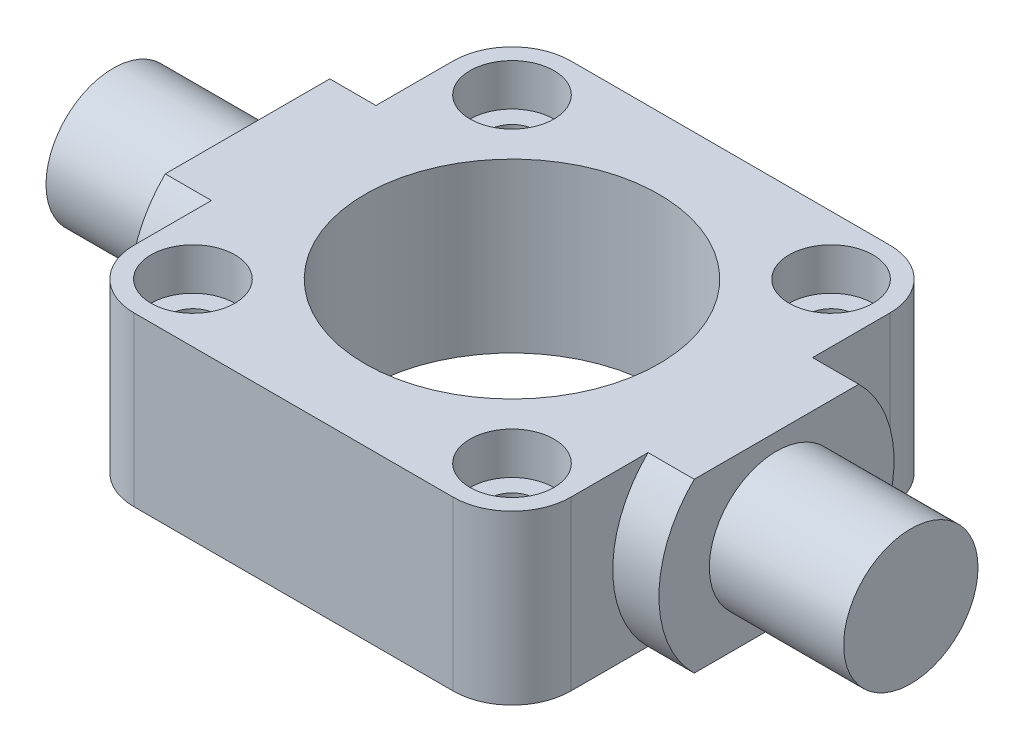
ISO-10303-21;
HEADER;
FILE_DESCRIPTION(('STEP AP214'),'2;1');
FILE_NAME('part.step','',(''),(''),'','','');
FILE_SCHEMA(('AUTOMOTIVE_DESIGN { 1 0 10303 214 1 1 1 1 }'));
ENDSEC;
DATA;
#1=APPLICATION_CONTEXT('core data for automotive mechanical design processes');
#2=APPLICATION_PROTOCOL_DEFINITION('international standard','automotive_design',2000,#1);
#3=PRODUCT_CONTEXT('',#1,'mechanical');
#4=PRODUCT('Part','Part','',(#3));
#5=PRODUCT_RELATED_PRODUCT_CATEGORY('part','',(#4));
#6=PRODUCT_DEFINITION_FORMATION('','',#4);
#7=PRODUCT_DEFINITION_CONTEXT('part definition',#1,'design');
#8=PRODUCT_DEFINITION('design','',#6,#7);
#9=PRODUCT_DEFINITION_SHAPE('','',#8);
#10=(LENGTH_UNIT() NAMED_UNIT(*) SI_UNIT(.MILLI.,.METRE.));
#11=(NAMED_UNIT(*) PLANE_ANGLE_UNIT() SI_UNIT($,.RADIAN.));
#12=(NAMED_UNIT(*) SI_UNIT($,.STERADIAN.) SOLID_ANGLE_UNIT());
#13=UNCERTAINTY_MEASURE_WITH_UNIT(LENGTH_MEASURE(1.E-05),#10,'distance_accuracy_value','');
#14=(GEOMETRIC_REPRESENTATION_CONTEXT(3) GLOBAL_UNCERTAINTY_ASSIGNED_CONTEXT((#13)) GLOBAL_UNIT_ASSIGNED_CONTEXT((#10,
#11,#12)) REPRESENTATION_CONTEXT('',''));
#15=CARTESIAN_POINT('',(0.,0.,0.));
#16=DIRECTION('',(0.,0.,1.));
#17=DIRECTION('',(1.,0.,0.));
#18=AXIS2_PLACEMENT_3D('',#15,#16,#17);
#19=CARTESIAN_POINT('',(-19.,20.0000000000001,19.));
#20=DIRECTION('',(0.,1.,0.));
#21=DIRECTION('',(0.,0.,1.));
#22=AXIS2_PLACEMENT_3D('',#19,#20,#21);
#23=PLANE('',#22);
#24=CARTESIAN_POINT('',(-19.0000000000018,20.0000000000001,-19.));
#25=DIRECTION('',(0.,1.,0.));
#26=DIRECTION('',(0.,0.,1.));
#27=AXIS2_PLACEMENT_3D('',#24,#25,#26);
#28=CIRCLE('',#27,5.);
#29=CARTESIAN_POINT('',(-19.0000000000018,20.0000000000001,-14.));
#30=VERTEX_POINT('',#29);
#31=EDGE_CURVE('E419',#30,#30,#28,.T.);
#32=ORIENTED_EDGE('',*,*,#31,.F.);
#33=EDGE_LOOP('',(#32));
#34=FACE_BOUND('',#33,.T.);
#35=CARTESIAN_POINT('',(18.9999999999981,20.0000000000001,-19.));
#36=DIRECTION('',(0.,1.,0.));
#37=DIRECTION('',(0.,0.,1.));
#38=AXIS2_PLACEMENT_3D('',#35,#36,#37);
#39=CIRCLE('',#38,5.);
#40=CARTESIAN_POINT('',(18.9999999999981,20.0000000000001,-14.));
#41=VERTEX_POINT('',#40);
#42=EDGE_CURVE('E327',#41,#41,#39,.T.);
#43=ORIENTED_EDGE('',*,*,#42,.F.);
#44=EDGE_LOOP('',(#43));
#45=FACE_BOUND('',#44,.T.);
#46=CARTESIAN_POINT('',(19.,20.0000000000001,19.));
#47=DIRECTION('',(0.,1.,0.));
#48=DIRECTION('',(0.,0.,1.));
#49=AXIS2_PLACEMENT_3D('',#46,#47,#48);
#50=CIRCLE('',#49,5.);
#51=CARTESIAN_POINT('',(19.,20.0000000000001,24.));
#52=VERTEX_POINT('',#51);
#53=EDGE_CURVE('E340',#52,#52,#50,.T.);
#54=ORIENTED_EDGE('',*,*,#53,.F.);
#55=EDGE_LOOP('',(#54));
#56=FACE_BOUND('',#55,.T.);
#57=CARTESIAN_POINT('',(-19.,20.0000000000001,19.));
#58=DIRECTION('',(0.,1.,0.));
#59=DIRECTION('',(0.,0.,1.));
#60=AXIS2_PLACEMENT_3D('',#57,#58,#59);
#61=CIRCLE('',#60,5.);
#62=CARTESIAN_POINT('',(-19.,20.0000000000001,24.));
#63=VERTEX_POINT('',#62);
#64=EDGE_CURVE('E356',#63,#63,#61,.T.);
#65=ORIENTED_EDGE('',*,*,#64,.F.);
#66=EDGE_LOOP('',(#65));
#67=FACE_BOUND('',#66,.T.);
#68=CARTESIAN_POINT('',(0.,20.0000000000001,0.));
#69=DIRECTION('',(0.,1.,0.));
#70=DIRECTION('',(0.,0.,1.));
#71=AXIS2_PLACEMENT_3D('',#68,#69,#70);
#72=CIRCLE('',#71,17.5);
#73=CARTESIAN_POINT('',(0.,20.0000000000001,17.5));
#74=VERTEX_POINT('',#73);
#75=EDGE_CURVE('E202',#74,#74,#72,.T.);
#76=ORIENTED_EDGE('',*,*,#75,.F.);
#77=EDGE_LOOP('',(#76));
#78=FACE_BOUND('',#77,.T.);
#79=DIRECTION('',(-1.,0.,0.));
#80=VECTOR('',#79,1.);
#81=CARTESIAN_POINT('',(47.5,20.,9.79795897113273));
#82=LINE('',#81,#80);
#83=CARTESIAN_POINT('',(31.5,20.,9.79795897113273));
#84=VERTEX_POINT('',#83);
#85=CARTESIAN_POINT('',(25.9999999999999,20.,9.79795897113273));
#86=VERTEX_POINT('',#85);
#87=EDGE_CURVE('E195',#84,#86,#82,.T.);
#88=ORIENTED_EDGE('',*,*,#87,.F.);
#89=DIRECTION('',(0.,0.,-1.));
#90=VECTOR('',#89,1.);
#91=CARTESIAN_POINT('',(31.5,20.,19.));
#92=LINE('',#91,#90);
#93=CARTESIAN_POINT('',(31.5,20.,-9.79795897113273));
#94=VERTEX_POINT('',#93);
#95=EDGE_CURVE('E55',#84,#94,#92,.T.);
#96=ORIENTED_EDGE('',*,*,#95,.T.);
#97=DIRECTION('',(-1.,0.,0.));
#98=VECTOR('',#97,1.);
#99=CARTESIAN_POINT('',(47.5,20.,-9.79795897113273));
#100=LINE('',#99,#98);
#101=CARTESIAN_POINT('',(25.9999999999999,20.,-9.79795897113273));
#102=VERTEX_POINT('',#101);
#103=EDGE_CURVE('E191',#102,#94,#100,.F.);
#104=ORIENTED_EDGE('',*,*,#103,.F.);
#105=DIRECTION('',(0.,0.,-1.));
#106=VECTOR('',#105,1.);
#107=CARTESIAN_POINT('',(25.9999999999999,20.,19.));
#108=LINE('',#107,#106);
#109=CARTESIAN_POINT('',(25.9999999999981,20.,-19.));
#110=VERTEX_POINT('',#109);
#111=EDGE_CURVE('E243',#102,#110,#108,.T.);
#112=ORIENTED_EDGE('',*,*,#111,.T.);
#113=CARTESIAN_POINT('',(18.9999999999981,20.0000000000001,-19.));
#114=DIRECTION('',(0.,1.,0.));
#115=DIRECTION('',(0.,0.,1.));
#116=AXIS2_PLACEMENT_3D('',#113,#114,#115);
#117=CIRCLE('',#116,7.);
#118=CARTESIAN_POINT('',(18.9999999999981,20.0000000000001,-26.));
#119=VERTEX_POINT('',#118);
#120=EDGE_CURVE('E248',#110,#119,#117,.T.);
#121=ORIENTED_EDGE('',*,*,#120,.T.);
#122=DIRECTION('',(-1.,0.,0.));
#123=VECTOR('',#122,1.);
#124=CARTESIAN_POINT('',(-19.0000000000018,20.0000000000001,-26.));
#125=LINE('',#124,#123);
#126=CARTESIAN_POINT('',(-19.0000000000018,20.0000000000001,-26.));
#127=VERTEX_POINT('',#126);
#128=EDGE_CURVE('E251',#119,#127,#125,.T.);
#129=ORIENTED_EDGE('',*,*,#128,.T.);
#130=CARTESIAN_POINT('',(-19.0000000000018,20.0000000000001,-19.));
#131=DIRECTION('',(0.,1.,0.));
#132=DIRECTION('',(0.,0.,-1.));
#133=AXIS2_PLACEMENT_3D('',#130,#131,#132);
#134=CIRCLE('',#133,7.);
#135=CARTESIAN_POINT('',(-26.0000000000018,20.0000000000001,-19.));
#136=VERTEX_POINT('',#135);
#137=EDGE_CURVE('E254',#127,#136,#134,.T.);
#138=ORIENTED_EDGE('',*,*,#137,.T.);
#139=DIRECTION('',(0.,0.,1.));
#140=VECTOR('',#139,1.);
#141=CARTESIAN_POINT('',(-26.,20.0000000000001,19.));
#142=LINE('',#141,#140);
#143=CARTESIAN_POINT('',(-26.0000000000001,20.0000000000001,-9.79795897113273));
#144=VERTEX_POINT('',#143);
#145=EDGE_CURVE('E258',#136,#144,#142,.T.);
#146=ORIENTED_EDGE('',*,*,#145,.T.);
#147=DIRECTION('',(1.,0.,0.));
#148=VECTOR('',#147,1.);
#149=CARTESIAN_POINT('',(-47.5000000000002,20.0000000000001,-9.79795897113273));
#150=LINE('',#149,#148);
#151=CARTESIAN_POINT('',(-31.5000000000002,20.0000000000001,-9.79795897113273));
#152=VERTEX_POINT('',#151);
#153=EDGE_CURVE('E188',#152,#144,#150,.T.);
#154=ORIENTED_EDGE('',*,*,#153,.F.);
#155=DIRECTION('',(0.,0.,1.));
#156=VECTOR('',#155,1.);
#157=CARTESIAN_POINT('',(-31.5000000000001,20.0000000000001,19.));
#158=LINE('',#157,#156);
#159=CARTESIAN_POINT('',(-31.5000000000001,20.0000000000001,9.79795897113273));
#160=VERTEX_POINT('',#159);
#161=EDGE_CURVE('E63',#152,#160,#158,.T.);
#162=ORIENTED_EDGE('',*,*,#161,.T.);
#163=DIRECTION('',(1.,0.,0.));
#164=VECTOR('',#163,1.);
#165=CARTESIAN_POINT('',(-47.5000000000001,20.0000000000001,9.79795897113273));
#166=LINE('',#165,#164);
#167=CARTESIAN_POINT('',(-26.,20.0000000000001,9.79795897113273));
#168=VERTEX_POINT('',#167);
#169=EDGE_CURVE('E178',#168,#160,#166,.F.);
#170=ORIENTED_EDGE('',*,*,#169,.F.);
#171=CARTESIAN_POINT('',(-26.,20.0000000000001,19.));
#172=VERTEX_POINT('',#171);
#173=EDGE_CURVE('E257',#168,#172,#142,.T.);
#174=ORIENTED_EDGE('',*,*,#173,.T.);
#175=CARTESIAN_POINT('',(-19.,20.0000000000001,19.));
#176=DIRECTION('',(0.,1.,0.));
#177=DIRECTION('',(0.,0.,1.));
#178=AXIS2_PLACEMENT_3D('',#175,#176,#177);
#179=CIRCLE('',#178,7.);
#180=CARTESIAN_POINT('',(-19.0000000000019,20.0000000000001,26.));
#181=VERTEX_POINT('',#180);
#182=EDGE_CURVE('E234',#172,#181,#179,.T.);
#183=ORIENTED_EDGE('',*,*,#182,.T.);
#184=DIRECTION('',(1.,0.,0.));
#185=VECTOR('',#184,1.);
#186=CARTESIAN_POINT('',(-19.0000000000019,20.0000000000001,26.));
#187=LINE('',#186,#185);
#188=CARTESIAN_POINT('',(18.9999999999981,20.0000000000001,26.));
#189=VERTEX_POINT('',#188);
#190=EDGE_CURVE('E238',#181,#189,#187,.T.);
#191=ORIENTED_EDGE('',*,*,#190,.T.);
#192=CARTESIAN_POINT('',(19.,20.0000000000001,19.));
#193=DIRECTION('',(0.,1.,0.));
#194=DIRECTION('',(0.,0.,-1.));
#195=AXIS2_PLACEMENT_3D('',#192,#193,#194);
#196=CIRCLE('',#195,7.);
#197=CARTESIAN_POINT('',(25.9999999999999,20.,19.));
#198=VERTEX_POINT('',#197);
#199=EDGE_CURVE('E240',#189,#198,#196,.T.);
#200=ORIENTED_EDGE('',*,*,#199,.T.);
#201=EDGE_CURVE('E244',#198,#86,#108,.T.);
#202=ORIENTED_EDGE('',*,*,#201,.T.);
#203=EDGE_LOOP('',(#88,#96,#104,#112,#121,#129,#138,#146,#154,#162,#170,#174,#183,#191,#200,#202));
#204=FACE_BOUND('',#203,.T.);
#205=ADVANCED_FACE('F40',(#34,#45,#56,#67,#78,#204),#23,.T.);
#206=CARTESIAN_POINT('',(-19.,0.,19.));
#207=DIRECTION('',(0.,1.,0.));
#208=DIRECTION('',(0.,0.,1.));
#209=AXIS2_PLACEMENT_3D('',#206,#207,#208);
#210=PLANE('',#209);
#211=CARTESIAN_POINT('',(-19.,0.,-19.));
#212=DIRECTION('',(0.,1.,0.));
#213=DIRECTION('',(0.,0.,1.));
#214=AXIS2_PLACEMENT_3D('',#211,#212,#213);
#215=CIRCLE('',#214,2.75);
#216=CARTESIAN_POINT('',(-19.,0.,-16.25));
#217=VERTEX_POINT('',#216);
#218=EDGE_CURVE('E446',#217,#217,#215,.T.);
#219=ORIENTED_EDGE('',*,*,#218,.T.);
#220=EDGE_LOOP('',(#219));
#221=FACE_BOUND('',#220,.T.);
#222=CARTESIAN_POINT('',(19.,0.,-19.));
#223=DIRECTION('',(0.,1.,0.));
#224=DIRECTION('',(0.,0.,1.));
#225=AXIS2_PLACEMENT_3D('',#222,#223,#224);
#226=CIRCLE('',#225,2.75);
#227=CARTESIAN_POINT('',(19.,0.,-16.25));
#228=VERTEX_POINT('',#227);
#229=EDGE_CURVE('E421',#228,#228,#226,.T.);
#230=ORIENTED_EDGE('',*,*,#229,.T.);
#231=EDGE_LOOP('',(#230));
#232=FACE_BOUND('',#231,.T.);
#233=CARTESIAN_POINT('',(19.,0.,19.));
#234=DIRECTION('',(0.,1.,0.));
#235=DIRECTION('',(0.,0.,1.));
#236=AXIS2_PLACEMENT_3D('',#233,#234,#235);
#237=CIRCLE('',#236,2.75);
#238=CARTESIAN_POINT('',(19.,0.,21.75));
#239=VERTEX_POINT('',#238);
#240=EDGE_CURVE('E323',#239,#239,#237,.T.);
#241=ORIENTED_EDGE('',*,*,#240,.T.);
#242=EDGE_LOOP('',(#241));
#243=FACE_BOUND('',#242,.T.);
#244=CARTESIAN_POINT('',(-19.,0.,19.));
#245=DIRECTION('',(0.,1.,0.));
#246=DIRECTION('',(0.,0.,1.));
#247=AXIS2_PLACEMENT_3D('',#244,#245,#246);
#248=CIRCLE('',#247,2.75);
#249=CARTESIAN_POINT('',(-19.,0.,21.75));
#250=VERTEX_POINT('',#249);
#251=EDGE_CURVE('E344',#250,#250,#248,.T.);
#252=ORIENTED_EDGE('',*,*,#251,.T.);
#253=EDGE_LOOP('',(#252));
#254=FACE_BOUND('',#253,.T.);
#255=CARTESIAN_POINT('',(0.,0.,0.));
#256=DIRECTION('',(0.,1.,0.));
#257=DIRECTION('',(0.,0.,1.));
#258=AXIS2_PLACEMENT_3D('',#255,#256,#257);
#259=CIRCLE('',#258,17.5);
#260=CARTESIAN_POINT('',(0.,0.,17.5));
#261=VERTEX_POINT('',#260);
#262=EDGE_CURVE('E198',#261,#261,#259,.T.);
#263=ORIENTED_EDGE('',*,*,#262,.T.);
#264=EDGE_LOOP('',(#263));
#265=FACE_BOUND('',#264,.T.);
#266=DIRECTION('',(0.,0.,-1.));
#267=VECTOR('',#266,1.);
#268=CARTESIAN_POINT('',(31.5,1.17961196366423E-13,19.));
#269=LINE('',#268,#267);
#270=CARTESIAN_POINT('',(31.5,1.17961196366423E-13,9.79795897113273));
#271=VERTEX_POINT('',#270);
#272=CARTESIAN_POINT('',(31.5,0.,-9.79795897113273));
#273=VERTEX_POINT('',#272);
#274=EDGE_CURVE('E152',#271,#273,#269,.T.);
#275=ORIENTED_EDGE('',*,*,#274,.F.);
#276=DIRECTION('',(-1.,0.,0.));
#277=VECTOR('',#276,1.);
#278=CARTESIAN_POINT('',(47.5,1.17961196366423E-13,9.79795897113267));
#279=LINE('',#278,#277);
#280=CARTESIAN_POINT('',(26.,1.17961196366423E-13,9.79795897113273));
#281=VERTEX_POINT('',#280);
#282=EDGE_CURVE('E161',#281,#271,#279,.F.);
#283=ORIENTED_EDGE('',*,*,#282,.F.);
#284=DIRECTION('',(0.,0.,-1.));
#285=VECTOR('',#284,1.);
#286=CARTESIAN_POINT('',(26.,1.17961196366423E-13,19.));
#287=LINE('',#286,#285);
#288=CARTESIAN_POINT('',(26.,1.17961196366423E-13,19.));
#289=VERTEX_POINT('',#288);
#290=EDGE_CURVE('E217',#289,#281,#287,.T.);
#291=ORIENTED_EDGE('',*,*,#290,.F.);
#292=CARTESIAN_POINT('',(19.,0.,19.));
#293=DIRECTION('',(0.,1.,0.));
#294=DIRECTION('',(0.,0.,-1.));
#295=AXIS2_PLACEMENT_3D('',#292,#293,#294);
#296=CIRCLE('',#295,7.);
#297=CARTESIAN_POINT('',(18.9999999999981,0.,26.));
#298=VERTEX_POINT('',#297);
#299=EDGE_CURVE('E213',#298,#289,#296,.T.);
#300=ORIENTED_EDGE('',*,*,#299,.F.);
#301=DIRECTION('',(1.,0.,0.));
#302=VECTOR('',#301,1.);
#303=CARTESIAN_POINT('',(-19.0000000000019,0.,26.));
#304=LINE('',#303,#302);
#305=CARTESIAN_POINT('',(-19.0000000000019,0.,26.));
#306=VERTEX_POINT('',#305);
#307=EDGE_CURVE('E210',#306,#298,#304,.T.);
#308=ORIENTED_EDGE('',*,*,#307,.F.);
#309=CARTESIAN_POINT('',(-19.,0.,19.));
#310=DIRECTION('',(0.,1.,0.));
#311=DIRECTION('',(0.,0.,1.));
#312=AXIS2_PLACEMENT_3D('',#309,#310,#311);
#313=CIRCLE('',#312,7.);
#314=CARTESIAN_POINT('',(-26.,0.,19.));
#315=VERTEX_POINT('',#314);
#316=EDGE_CURVE('E206',#315,#306,#313,.T.);
#317=ORIENTED_EDGE('',*,*,#316,.F.);
#318=DIRECTION('',(0.,0.,1.));
#319=VECTOR('',#318,1.);
#320=CARTESIAN_POINT('',(-26.,0.,19.));
#321=LINE('',#320,#319);
#322=CARTESIAN_POINT('',(-26.,1.17961196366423E-13,9.79795897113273));
#323=VERTEX_POINT('',#322);
#324=EDGE_CURVE('E229',#323,#315,#321,.T.);
#325=ORIENTED_EDGE('',*,*,#324,.F.);
#326=DIRECTION('',(1.,0.,0.));
#327=VECTOR('',#326,1.);
#328=CARTESIAN_POINT('',(-47.5,1.17961196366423E-13,9.79795897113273));
#329=LINE('',#328,#327);
#330=CARTESIAN_POINT('',(-31.5,1.17961196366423E-13,9.79795897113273));
#331=VERTEX_POINT('',#330);
#332=EDGE_CURVE('E173',#331,#323,#329,.T.);
#333=ORIENTED_EDGE('',*,*,#332,.F.);
#334=DIRECTION('',(0.,0.,1.));
#335=VECTOR('',#334,1.);
#336=CARTESIAN_POINT('',(-31.5,0.,19.));
#337=LINE('',#336,#335);
#338=CARTESIAN_POINT('',(-31.5,0.,-9.79795897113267));
#339=VERTEX_POINT('',#338);
#340=EDGE_CURVE('E379',#339,#331,#337,.T.);
#341=ORIENTED_EDGE('',*,*,#340,.F.);
#342=DIRECTION('',(1.,0.,0.));
#343=VECTOR('',#342,1.);
#344=CARTESIAN_POINT('',(-47.5,0.,-9.79795897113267));
#345=LINE('',#344,#343);
#346=CARTESIAN_POINT('',(-26.,0.,-9.79795897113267));
#347=VERTEX_POINT('',#346);
#348=EDGE_CURVE('E181',#347,#339,#345,.F.);
#349=ORIENTED_EDGE('',*,*,#348,.F.);
#350=CARTESIAN_POINT('',(-26.,0.,-19.));
#351=VERTEX_POINT('',#350);
#352=EDGE_CURVE('E230',#351,#347,#321,.T.);
#353=ORIENTED_EDGE('',*,*,#352,.F.);
#354=CARTESIAN_POINT('',(-19.,0.,-19.));
#355=DIRECTION('',(0.,1.,0.));
#356=DIRECTION('',(0.,0.,-1.));
#357=AXIS2_PLACEMENT_3D('',#354,#355,#356);
#358=CIRCLE('',#357,7.);
#359=CARTESIAN_POINT('',(-19.,0.,-26.));
#360=VERTEX_POINT('',#359);
#361=EDGE_CURVE('E226',#360,#351,#358,.T.);
#362=ORIENTED_EDGE('',*,*,#361,.F.);
#363=DIRECTION('',(-1.,0.,0.));
#364=VECTOR('',#363,1.);
#365=CARTESIAN_POINT('',(-19.,0.,-26.));
#366=LINE('',#365,#364);
#367=CARTESIAN_POINT('',(19.,0.,-26.));
#368=VERTEX_POINT('',#367);
#369=EDGE_CURVE('E223',#368,#360,#366,.T.);
#370=ORIENTED_EDGE('',*,*,#369,.F.);
#371=CARTESIAN_POINT('',(19.,0.,-19.));
#372=DIRECTION('',(0.,1.,0.));
#373=DIRECTION('',(0.,0.,1.));
#374=AXIS2_PLACEMENT_3D('',#371,#372,#373);
#375=CIRCLE('',#374,7.);
#376=CARTESIAN_POINT('',(26.,1.17961196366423E-13,-19.));
#377=VERTEX_POINT('',#376);
#378=EDGE_CURVE('E220',#377,#368,#375,.T.);
#379=ORIENTED_EDGE('',*,*,#378,.F.);
#380=CARTESIAN_POINT('',(26.,0.,-9.79795897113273));
#381=VERTEX_POINT('',#380);
#382=EDGE_CURVE('E216',#381,#377,#287,.T.);
#383=ORIENTED_EDGE('',*,*,#382,.F.);
#384=DIRECTION('',(-1.,0.,0.));
#385=VECTOR('',#384,1.);
#386=CARTESIAN_POINT('',(47.5,0.,-9.79795897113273));
#387=LINE('',#386,#385);
#388=EDGE_CURVE('E164',#273,#381,#387,.T.);
#389=ORIENTED_EDGE('',*,*,#388,.F.);
#390=EDGE_LOOP('',(#275,#283,#291,#300,#308,#317,#325,#333,#341,#349,#353,#362,#370,#379,#383,#389));
#391=FACE_BOUND('',#390,.T.);
#392=ADVANCED_FACE('F159',(#221,#232,#243,#254,#265,#391),#210,.F.);
#393=CARTESIAN_POINT('',(47.5,10.0000000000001,0.));
#394=DIRECTION('',(-1.,0.,0.));
#395=DIRECTION('',(0.,0.,1.));
#396=AXIS2_PLACEMENT_3D('',#393,#394,#395);
#397=CYLINDRICAL_SURFACE('',#396,14.);
#398=CARTESIAN_POINT('',(31.5,10.0000000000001,0.));
#399=DIRECTION('',(1.,0.,0.));
#400=DIRECTION('',(0.,0.,-1.));
#401=AXIS2_PLACEMENT_3D('',#398,#399,#400);
#402=CIRCLE('',#401,14.);
#403=EDGE_CURVE('E368',#273,#94,#402,.T.);
#404=ORIENTED_EDGE('',*,*,#403,.F.);
#405=ORIENTED_EDGE('',*,*,#388,.T.);
#406=CARTESIAN_POINT('',(26.,10.0000000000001,9.43689570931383E-13));
#407=DIRECTION('',(-1.,0.,0.));
#408=DIRECTION('',(0.,0.,1.));
#409=AXIS2_PLACEMENT_3D('',#406,#407,#408);
#410=CIRCLE('',#409,14.);
#411=EDGE_CURVE('E295',#381,#102,#410,.F.);
#412=ORIENTED_EDGE('',*,*,#411,.T.);
#413=ORIENTED_EDGE('',*,*,#103,.T.);
#414=EDGE_LOOP('',(#404,#405,#412,#413));
#415=FACE_BOUND('',#414,.T.);
#416=ADVANCED_FACE('F426',(#415),#397,.T.);
#417=CARTESIAN_POINT('',(31.5,10.0000000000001,0.));
#418=DIRECTION('',(1.,0.,0.));
#419=DIRECTION('',(0.,0.,-1.));
#420=AXIS2_PLACEMENT_3D('',#417,#418,#419);
#421=CIRCLE('',#420,14.);
#422=EDGE_CURVE('E12',#84,#271,#421,.T.);
#423=ORIENTED_EDGE('',*,*,#422,.F.);
#424=ORIENTED_EDGE('',*,*,#87,.T.);
#425=EDGE_CURVE('E171',#86,#281,#410,.F.);
#426=ORIENTED_EDGE('',*,*,#425,.T.);
#427=ORIENTED_EDGE('',*,*,#282,.T.);
#428=EDGE_LOOP('',(#423,#424,#426,#427));
#429=FACE_BOUND('',#428,.T.);
#430=ADVANCED_FACE('F169',(#429),#397,.T.);
#431=CARTESIAN_POINT('',(-47.5,10.,0.));
#432=DIRECTION('',(1.,0.,0.));
#433=DIRECTION('',(0.,0.,-1.));
#434=AXIS2_PLACEMENT_3D('',#431,#432,#433);
#435=CYLINDRICAL_SURFACE('',#434,14.);
#436=CARTESIAN_POINT('',(-31.5,10.,0.));
#437=DIRECTION('',(-1.,0.,0.));
#438=DIRECTION('',(0.,0.,1.));
#439=AXIS2_PLACEMENT_3D('',#436,#437,#438);
#440=CIRCLE('',#439,14.);
#441=EDGE_CURVE('E383',#331,#160,#440,.T.);
#442=ORIENTED_EDGE('',*,*,#441,.F.);
#443=ORIENTED_EDGE('',*,*,#332,.T.);
#444=CARTESIAN_POINT('',(-26.,10.,0.));
#445=DIRECTION('',(1.,0.,0.));
#446=DIRECTION('',(0.,0.,-1.));
#447=AXIS2_PLACEMENT_3D('',#444,#445,#446);
#448=CIRCLE('',#447,14.);
#449=EDGE_CURVE('E299',#323,#168,#448,.F.);
#450=ORIENTED_EDGE('',*,*,#449,.T.);
#451=ORIENTED_EDGE('',*,*,#169,.T.);
#452=EDGE_LOOP('',(#442,#443,#450,#451));
#453=FACE_BOUND('',#452,.T.);
#454=ADVANCED_FACE('F310',(#453),#435,.T.);
#455=CARTESIAN_POINT('',(-31.5,10.,0.));
#456=DIRECTION('',(-1.,0.,0.));
#457=DIRECTION('',(0.,0.,1.));
#458=AXIS2_PLACEMENT_3D('',#455,#456,#457);
#459=CIRCLE('',#458,14.);
#460=EDGE_CURVE('E49',#152,#339,#459,.T.);
#461=ORIENTED_EDGE('',*,*,#460,.F.);
#462=ORIENTED_EDGE('',*,*,#153,.T.);
#463=EDGE_CURVE('E296',#144,#347,#448,.F.);
#464=ORIENTED_EDGE('',*,*,#463,.T.);
#465=ORIENTED_EDGE('',*,*,#348,.T.);
#466=EDGE_LOOP('',(#461,#462,#464,#465));
#467=FACE_BOUND('',#466,.T.);
#468=ADVANCED_FACE('F388',(#467),#435,.T.);
#469=CARTESIAN_POINT('',(-26.,20.0000000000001,19.));
#470=DIRECTION('',(1.,0.,0.));
#471=DIRECTION('',(0.,0.,-1.));
#472=AXIS2_PLACEMENT_3D('',#469,#470,#471);
#473=PLANE('',#472);
#474=ORIENTED_EDGE('',*,*,#449,.F.);
#475=ORIENTED_EDGE('',*,*,#324,.T.);
#476=DIRECTION('',(0.,-1.,0.));
#477=VECTOR('',#476,1.);
#478=CARTESIAN_POINT('',(-26.,20.0000000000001,19.));
#479=LINE('',#478,#477);
#480=EDGE_CURVE('E262',#172,#315,#479,.T.);
#481=ORIENTED_EDGE('',*,*,#480,.F.);
#482=ORIENTED_EDGE('',*,*,#173,.F.);
#483=EDGE_LOOP('',(#474,#475,#481,#482));
#484=FACE_BOUND('',#483,.T.);
#485=ADVANCED_FACE('F315',(#484),#473,.F.);
#486=ORIENTED_EDGE('',*,*,#463,.F.);
#487=ORIENTED_EDGE('',*,*,#145,.F.);
#488=DIRECTION('',(0.,-1.,0.));
#489=VECTOR('',#488,1.);
#490=CARTESIAN_POINT('',(-26.0000000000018,20.0000000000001,-19.));
#491=LINE('',#490,#489);
#492=EDGE_CURVE('E266',#136,#351,#491,.T.);
#493=ORIENTED_EDGE('',*,*,#492,.T.);
#494=ORIENTED_EDGE('',*,*,#352,.T.);
#495=EDGE_LOOP('',(#486,#487,#493,#494));
#496=FACE_BOUND('',#495,.T.);
#497=ADVANCED_FACE('F394',(#496),#473,.F.);
#498=CARTESIAN_POINT('',(25.9999999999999,20.,19.));
#499=DIRECTION('',(-1.,0.,0.));
#500=DIRECTION('',(0.,0.,1.));
#501=AXIS2_PLACEMENT_3D('',#498,#499,#500);
#502=PLANE('',#501);
#503=ORIENTED_EDGE('',*,*,#411,.F.);
#504=ORIENTED_EDGE('',*,*,#382,.T.);
#505=DIRECTION('',(0.,-1.,0.));
#506=VECTOR('',#505,1.);
#507=CARTESIAN_POINT('',(25.9999999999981,20.,-19.));
#508=LINE('',#507,#506);
#509=EDGE_CURVE('E277',#110,#377,#508,.T.);
#510=ORIENTED_EDGE('',*,*,#509,.F.);
#511=ORIENTED_EDGE('',*,*,#111,.F.);
#512=EDGE_LOOP('',(#503,#504,#510,#511));
#513=FACE_BOUND('',#512,.T.);
#514=ADVANCED_FACE('F414',(#513),#502,.F.);
#515=ORIENTED_EDGE('',*,*,#425,.F.);
#516=ORIENTED_EDGE('',*,*,#201,.F.);
#517=DIRECTION('',(0.,-1.,0.));
#518=VECTOR('',#517,1.);
#519=CARTESIAN_POINT('',(25.9999999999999,20.,19.));
#520=LINE('',#519,#518);
#521=EDGE_CURVE('E281',#198,#289,#520,.T.);
#522=ORIENTED_EDGE('',*,*,#521,.T.);
#523=ORIENTED_EDGE('',*,*,#290,.T.);
#524=EDGE_LOOP('',(#515,#516,#522,#523));
#525=FACE_BOUND('',#524,.T.);
#526=ADVANCED_FACE('F430',(#525),#502,.F.);
#527=CARTESIAN_POINT('',(-19.,20.0000000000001,19.));
#528=DIRECTION('',(0.,-1.,0.));
#529=DIRECTION('',(0.,0.,-1.));
#530=AXIS2_PLACEMENT_3D('',#527,#528,#529);
#531=CYLINDRICAL_SURFACE('',#530,7.);
#532=ORIENTED_EDGE('',*,*,#316,.T.);
#533=DIRECTION('',(0.,-1.,0.));
#534=VECTOR('',#533,1.);
#535=CARTESIAN_POINT('',(-19.0000000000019,20.0000000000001,26.));
#536=LINE('',#535,#534);
#537=EDGE_CURVE('E289',#181,#306,#536,.T.);
#538=ORIENTED_EDGE('',*,*,#537,.F.);
#539=ORIENTED_EDGE('',*,*,#182,.F.);
#540=ORIENTED_EDGE('',*,*,#480,.T.);
#541=EDGE_LOOP('',(#532,#538,#539,#540));
#542=FACE_BOUND('',#541,.T.);
#543=ADVANCED_FACE('F42',(#542),#531,.T.);
#544=CARTESIAN_POINT('',(-19.0000000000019,20.0000000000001,26.));
#545=DIRECTION('',(0.,0.,-1.));
#546=DIRECTION('',(-1.,0.,0.));
#547=AXIS2_PLACEMENT_3D('',#544,#545,#546);
#548=PLANE('',#547);
#549=ORIENTED_EDGE('',*,*,#307,.T.);
#550=DIRECTION('',(0.,-1.,0.));
#551=VECTOR('',#550,1.);
#552=CARTESIAN_POINT('',(18.9999999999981,20.0000000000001,26.));
#553=LINE('',#552,#551);
#554=EDGE_CURVE('E285',#189,#298,#553,.T.);
#555=ORIENTED_EDGE('',*,*,#554,.F.);
#556=ORIENTED_EDGE('',*,*,#190,.F.);
#557=ORIENTED_EDGE('',*,*,#537,.T.);
#558=EDGE_LOOP('',(#549,#555,#556,#557));
#559=FACE_BOUND('',#558,.T.);
#560=ADVANCED_FACE('F438',(#559),#548,.F.);
#561=CARTESIAN_POINT('',(19.,20.0000000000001,19.));
#562=DIRECTION('',(0.,-1.,0.));
#563=DIRECTION('',(0.,0.,-1.));
#564=AXIS2_PLACEMENT_3D('',#561,#562,#563);
#565=CYLINDRICAL_SURFACE('',#564,7.);
#566=ORIENTED_EDGE('',*,*,#299,.T.);
#567=ORIENTED_EDGE('',*,*,#521,.F.);
#568=ORIENTED_EDGE('',*,*,#199,.F.);
#569=ORIENTED_EDGE('',*,*,#554,.T.);
#570=EDGE_LOOP('',(#566,#567,#568,#569));
#571=FACE_BOUND('',#570,.T.);
#572=ADVANCED_FACE('F434',(#571),#565,.T.);
#573=CARTESIAN_POINT('',(18.9999999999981,20.0000000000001,-19.));
#574=DIRECTION('',(0.,-1.,0.));
#575=DIRECTION('',(0.,0.,-1.));
#576=AXIS2_PLACEMENT_3D('',#573,#574,#575);
#577=CYLINDRICAL_SURFACE('',#576,7.);
#578=ORIENTED_EDGE('',*,*,#378,.T.);
#579=DIRECTION('',(0.,-1.,0.));
#580=VECTOR('',#579,1.);
#581=CARTESIAN_POINT('',(18.9999999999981,20.0000000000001,-26.));
#582=LINE('',#581,#580);
#583=EDGE_CURVE('E274',#119,#368,#582,.T.);
#584=ORIENTED_EDGE('',*,*,#583,.F.);
#585=ORIENTED_EDGE('',*,*,#120,.F.);
#586=ORIENTED_EDGE('',*,*,#509,.T.);
#587=EDGE_LOOP('',(#578,#584,#585,#586));
#588=FACE_BOUND('',#587,.T.);
#589=ADVANCED_FACE('F409',(#588),#577,.T.);
#590=CARTESIAN_POINT('',(-19.0000000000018,20.0000000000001,-26.));
#591=DIRECTION('',(0.,0.,1.));
#592=DIRECTION('',(1.,0.,0.));
#593=AXIS2_PLACEMENT_3D('',#590,#591,#592);
#594=PLANE('',#593);
#595=ORIENTED_EDGE('',*,*,#369,.T.);
#596=DIRECTION('',(0.,-1.,0.));
#597=VECTOR('',#596,1.);
#598=CARTESIAN_POINT('',(-19.0000000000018,20.0000000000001,-26.));
#599=LINE('',#598,#597);
#600=EDGE_CURVE('E270',#127,#360,#599,.T.);
#601=ORIENTED_EDGE('',*,*,#600,.F.);
#602=ORIENTED_EDGE('',*,*,#128,.F.);
#603=ORIENTED_EDGE('',*,*,#583,.T.);
#604=EDGE_LOOP('',(#595,#601,#602,#603));
#605=FACE_BOUND('',#604,.T.);
#606=ADVANCED_FACE('F404',(#605),#594,.F.);
#607=CARTESIAN_POINT('',(-19.0000000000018,20.0000000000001,-19.));
#608=DIRECTION('',(0.,-1.,0.));
#609=DIRECTION('',(0.,0.,-1.));
#610=AXIS2_PLACEMENT_3D('',#607,#608,#609);
#611=CYLINDRICAL_SURFACE('',#610,7.);
#612=ORIENTED_EDGE('',*,*,#361,.T.);
#613=ORIENTED_EDGE('',*,*,#492,.F.);
#614=ORIENTED_EDGE('',*,*,#137,.F.);
#615=ORIENTED_EDGE('',*,*,#600,.T.);
#616=EDGE_LOOP('',(#612,#613,#614,#615));
#617=FACE_BOUND('',#616,.T.);
#618=ADVANCED_FACE('F399',(#617),#611,.T.);
#619=CARTESIAN_POINT('',(0.,20.0000000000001,0.));
#620=DIRECTION('',(0.,-1.,0.));
#621=DIRECTION('',(0.,0.,-1.));
#622=AXIS2_PLACEMENT_3D('',#619,#620,#621);
#623=CYLINDRICAL_SURFACE('',#622,17.5);
#624=ORIENTED_EDGE('',*,*,#75,.T.);
#625=EDGE_LOOP('',(#624));
#626=FACE_BOUND('',#625,.T.);
#627=ORIENTED_EDGE('',*,*,#262,.F.);
#628=EDGE_LOOP('',(#627));
#629=FACE_BOUND('',#628,.T.);
#630=ADVANCED_FACE('F483',(#626,#629),#623,.F.);
#631=CARTESIAN_POINT('',(-31.5,10.,0.));
#632=DIRECTION('',(-1.,0.,0.));
#633=DIRECTION('',(0.,0.,1.));
#634=AXIS2_PLACEMENT_3D('',#631,#632,#633);
#635=PLANE('',#634);
#636=CARTESIAN_POINT('',(-31.5,10.,0.));
#637=DIRECTION('',(-1.,0.,0.));
#638=DIRECTION('',(0.,0.,1.));
#639=AXIS2_PLACEMENT_3D('',#636,#637,#638);
#640=CIRCLE('',#639,8.);
#641=CARTESIAN_POINT('',(-31.5,10.,8.));
#642=VERTEX_POINT('',#641);
#643=EDGE_CURVE('E375',#642,#642,#640,.T.);
#644=ORIENTED_EDGE('',*,*,#643,.F.);
#645=EDGE_LOOP('',(#644));
#646=FACE_BOUND('',#645,.T.);
#647=ORIENTED_EDGE('',*,*,#441,.T.);
#648=ORIENTED_EDGE('',*,*,#161,.F.);
#649=ORIENTED_EDGE('',*,*,#460,.T.);
#650=ORIENTED_EDGE('',*,*,#340,.T.);
#651=EDGE_LOOP('',(#647,#648,#649,#650));
#652=FACE_BOUND('',#651,.T.);
#653=ADVANCED_FACE('F486',(#646,#652),#635,.T.);
#654=CARTESIAN_POINT('',(-31.5,10.,0.));
#655=DIRECTION('',(-1.,0.,0.));
#656=DIRECTION('',(0.,0.,1.));
#657=AXIS2_PLACEMENT_3D('',#654,#655,#656);
#658=CYLINDRICAL_SURFACE('',#657,8.);
#659=ORIENTED_EDGE('',*,*,#643,.T.);
#660=EDGE_LOOP('',(#659));
#661=FACE_BOUND('',#660,.T.);
#662=CARTESIAN_POINT('',(-47.5,10.,0.));
#663=DIRECTION('',(-1.,0.,0.));
#664=DIRECTION('',(0.,0.,1.));
#665=AXIS2_PLACEMENT_3D('',#662,#663,#664);
#666=CIRCLE('',#665,8.);
#667=CARTESIAN_POINT('',(-47.5,10.,8.));
#668=VERTEX_POINT('',#667);
#669=EDGE_CURVE('E371',#668,#668,#666,.T.);
#670=ORIENTED_EDGE('',*,*,#669,.F.);
#671=EDGE_LOOP('',(#670));
#672=FACE_BOUND('',#671,.T.);
#673=ADVANCED_FACE('F731',(#661,#672),#658,.T.);
#674=CARTESIAN_POINT('',(-47.5,10.,0.));
#675=DIRECTION('',(-1.,0.,0.));
#676=DIRECTION('',(0.,0.,1.));
#677=AXIS2_PLACEMENT_3D('',#674,#675,#676);
#678=PLANE('',#677);
#679=ORIENTED_EDGE('',*,*,#669,.T.);
#680=EDGE_LOOP('',(#679));
#681=FACE_BOUND('',#680,.T.);
#682=ADVANCED_FACE('F576',(#681),#678,.T.);
#683=CARTESIAN_POINT('',(31.5,10.0000000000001,0.));
#684=DIRECTION('',(1.,0.,0.));
#685=DIRECTION('',(0.,0.,-1.));
#686=AXIS2_PLACEMENT_3D('',#683,#684,#685);
#687=PLANE('',#686);
#688=CARTESIAN_POINT('',(31.5,10.0000000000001,0.));
#689=DIRECTION('',(1.,0.,0.));
#690=DIRECTION('',(0.,0.,-1.));
#691=AXIS2_PLACEMENT_3D('',#688,#689,#690);
#692=CIRCLE('',#691,8.);
#693=CARTESIAN_POINT('',(31.5,10.0000000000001,-7.99999999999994));
#694=VERTEX_POINT('',#693);
#695=EDGE_CURVE('E166',#694,#694,#692,.T.);
#696=ORIENTED_EDGE('',*,*,#695,.F.);
#697=EDGE_LOOP('',(#696));
#698=FACE_BOUND('',#697,.T.);
#699=ORIENTED_EDGE('',*,*,#403,.T.);
#700=ORIENTED_EDGE('',*,*,#95,.F.);
#701=ORIENTED_EDGE('',*,*,#422,.T.);
#702=ORIENTED_EDGE('',*,*,#274,.T.);
#703=EDGE_LOOP('',(#699,#700,#701,#702));
#704=FACE_BOUND('',#703,.T.);
#705=ADVANCED_FACE('F151',(#698,#704),#687,.T.);
#706=CARTESIAN_POINT('',(31.5,10.0000000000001,0.));
#707=DIRECTION('',(1.,0.,0.));
#708=DIRECTION('',(0.,0.,-1.));
#709=AXIS2_PLACEMENT_3D('',#706,#707,#708);
#710=CYLINDRICAL_SURFACE('',#709,8.);
#711=ORIENTED_EDGE('',*,*,#695,.T.);
#712=EDGE_LOOP('',(#711));
#713=FACE_BOUND('',#712,.T.);
#714=CARTESIAN_POINT('',(47.5,10.0000000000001,0.));
#715=DIRECTION('',(1.,0.,0.));
#716=DIRECTION('',(0.,0.,-1.));
#717=AXIS2_PLACEMENT_3D('',#714,#715,#716);
#718=CIRCLE('',#717,8.);
#719=CARTESIAN_POINT('',(47.5,10.0000000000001,-8.));
#720=VERTEX_POINT('',#719);
#721=EDGE_CURVE('E360',#720,#720,#718,.T.);
#722=ORIENTED_EDGE('',*,*,#721,.F.);
#723=EDGE_LOOP('',(#722));
#724=FACE_BOUND('',#723,.T.);
#725=ADVANCED_FACE('F575',(#713,#724),#710,.T.);
#726=CARTESIAN_POINT('',(47.5,10.0000000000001,0.));
#727=DIRECTION('',(1.,0.,0.));
#728=DIRECTION('',(0.,0.,-1.));
#729=AXIS2_PLACEMENT_3D('',#726,#727,#728);
#730=PLANE('',#729);
#731=ORIENTED_EDGE('',*,*,#721,.T.);
#732=EDGE_LOOP('',(#731));
#733=FACE_BOUND('',#732,.T.);
#734=ADVANCED_FACE('F586',(#733),#730,.T.);
#735=CARTESIAN_POINT('',(-19.,20.0000000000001,19.));
#736=DIRECTION('',(0.,1.,0.));
#737=DIRECTION('',(0.,0.,1.));
#738=AXIS2_PLACEMENT_3D('',#735,#736,#737);
#739=CYLINDRICAL_SURFACE('',#738,5.);
#740=CARTESIAN_POINT('',(-19.,15.0000000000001,19.));
#741=DIRECTION('',(0.,1.,0.));
#742=DIRECTION('',(0.,0.,1.));
#743=AXIS2_PLACEMENT_3D('',#740,#741,#742);
#744=CIRCLE('',#743,5.);
#745=CARTESIAN_POINT('',(-19.,15.0000000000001,24.));
#746=VERTEX_POINT('',#745);
#747=EDGE_CURVE('E352',#746,#746,#744,.T.);
#748=ORIENTED_EDGE('',*,*,#747,.F.);
#749=EDGE_LOOP('',(#748));
#750=FACE_BOUND('',#749,.T.);
#751=ORIENTED_EDGE('',*,*,#64,.T.);
#752=EDGE_LOOP('',(#751));
#753=FACE_BOUND('',#752,.T.);
#754=ADVANCED_FACE('F591',(#750,#753),#739,.F.);
#755=CARTESIAN_POINT('',(-16.25,15.0000000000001,19.));
#756=DIRECTION('',(0.,-1.,0.));
#757=DIRECTION('',(0.,0.,-1.));
#758=AXIS2_PLACEMENT_3D('',#755,#756,#757);
#759=PLANE('',#758);
#760=CARTESIAN_POINT('',(-19.,15.0000000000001,19.));
#761=DIRECTION('',(0.,1.,0.));
#762=DIRECTION('',(0.,0.,1.));
#763=AXIS2_PLACEMENT_3D('',#760,#761,#762);
#764=CIRCLE('',#763,2.75);
#765=CARTESIAN_POINT('',(-19.,15.0000000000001,21.75));
#766=VERTEX_POINT('',#765);
#767=EDGE_CURVE('E348',#766,#766,#764,.T.);
#768=ORIENTED_EDGE('',*,*,#767,.F.);
#769=EDGE_LOOP('',(#768));
#770=FACE_BOUND('',#769,.T.);
#771=ORIENTED_EDGE('',*,*,#747,.T.);
#772=EDGE_LOOP('',(#771));
#773=FACE_BOUND('',#772,.T.);
#774=ADVANCED_FACE('F597',(#770,#773),#759,.F.);
#775=CARTESIAN_POINT('',(-19.,20.0000000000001,19.));
#776=DIRECTION('',(0.,1.,0.));
#777=DIRECTION('',(0.,0.,1.));
#778=AXIS2_PLACEMENT_3D('',#775,#776,#777);
#779=CYLINDRICAL_SURFACE('',#778,2.75);
#780=ORIENTED_EDGE('',*,*,#251,.F.);
#781=EDGE_LOOP('',(#780));
#782=FACE_BOUND('',#781,.T.);
#783=ORIENTED_EDGE('',*,*,#767,.T.);
#784=EDGE_LOOP('',(#783));
#785=FACE_BOUND('',#784,.T.);
#786=ADVANCED_FACE('F606',(#782,#785),#779,.F.);
#787=CARTESIAN_POINT('',(19.,20.0000000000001,19.));
#788=DIRECTION('',(0.,1.,0.));
#789=DIRECTION('',(0.,0.,1.));
#790=AXIS2_PLACEMENT_3D('',#787,#788,#789);
#791=CYLINDRICAL_SURFACE('',#790,5.);
#792=CARTESIAN_POINT('',(19.,15.0000000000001,19.));
#793=DIRECTION('',(0.,1.,0.));
#794=DIRECTION('',(0.,0.,1.));
#795=AXIS2_PLACEMENT_3D('',#792,#793,#794);
#796=CIRCLE('',#795,5.);
#797=CARTESIAN_POINT('',(19.,15.0000000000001,24.));
#798=VERTEX_POINT('',#797);
#799=EDGE_CURVE('E322',#798,#798,#796,.T.);
#800=ORIENTED_EDGE('',*,*,#799,.F.);
#801=EDGE_LOOP('',(#800));
#802=FACE_BOUND('',#801,.T.);
#803=ORIENTED_EDGE('',*,*,#53,.T.);
#804=EDGE_LOOP('',(#803));
#805=FACE_BOUND('',#804,.T.);
#806=ADVANCED_FACE('F615',(#802,#805),#791,.F.);
#807=CARTESIAN_POINT('',(21.7499999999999,15.0000000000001,19.));
#808=DIRECTION('',(0.,-1.,0.));
#809=DIRECTION('',(0.,0.,-1.));
#810=AXIS2_PLACEMENT_3D('',#807,#808,#809);
#811=PLANE('',#810);
#812=CARTESIAN_POINT('',(19.,15.0000000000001,19.));
#813=DIRECTION('',(0.,1.,0.));
#814=DIRECTION('',(0.,0.,1.));
#815=AXIS2_PLACEMENT_3D('',#812,#813,#814);
#816=CIRCLE('',#815,2.75);
#817=CARTESIAN_POINT('',(19.,15.0000000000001,21.75));
#818=VERTEX_POINT('',#817);
#819=EDGE_CURVE('E320',#818,#818,#816,.T.);
#820=ORIENTED_EDGE('',*,*,#819,.F.);
#821=EDGE_LOOP('',(#820));
#822=FACE_BOUND('',#821,.T.);
#823=ORIENTED_EDGE('',*,*,#799,.T.);
#824=EDGE_LOOP('',(#823));
#825=FACE_BOUND('',#824,.T.);
#826=ADVANCED_FACE('F624',(#822,#825),#811,.F.);
#827=CARTESIAN_POINT('',(19.,20.0000000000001,19.));
#828=DIRECTION('',(0.,1.,0.));
#829=DIRECTION('',(0.,0.,1.));
#830=AXIS2_PLACEMENT_3D('',#827,#828,#829);
#831=CYLINDRICAL_SURFACE('',#830,2.75);
#832=ORIENTED_EDGE('',*,*,#240,.F.);
#833=EDGE_LOOP('',(#832));
#834=FACE_BOUND('',#833,.T.);
#835=ORIENTED_EDGE('',*,*,#819,.T.);
#836=EDGE_LOOP('',(#835));
#837=FACE_BOUND('',#836,.T.);
#838=ADVANCED_FACE('F469',(#834,#837),#831,.F.);
#839=CARTESIAN_POINT('',(18.9999999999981,20.0000000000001,-19.));
#840=DIRECTION('',(0.,1.,0.));
#841=DIRECTION('',(0.,0.,1.));
#842=AXIS2_PLACEMENT_3D('',#839,#840,#841);
#843=CYLINDRICAL_SURFACE('',#842,5.);
#844=CARTESIAN_POINT('',(18.9999999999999,15.0000000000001,-19.));
#845=DIRECTION('',(0.,1.,0.));
#846=DIRECTION('',(0.,0.,1.));
#847=AXIS2_PLACEMENT_3D('',#844,#845,#846);
#848=CIRCLE('',#847,5.);
#849=CARTESIAN_POINT('',(18.9999999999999,15.0000000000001,-14.));
#850=VERTEX_POINT('',#849);
#851=EDGE_CURVE('E333',#850,#850,#848,.T.);
#852=ORIENTED_EDGE('',*,*,#851,.F.);
#853=EDGE_LOOP('',(#852));
#854=FACE_BOUND('',#853,.T.);
#855=ORIENTED_EDGE('',*,*,#42,.T.);
#856=EDGE_LOOP('',(#855));
#857=FACE_BOUND('',#856,.T.);
#858=ADVANCED_FACE('F466',(#854,#857),#843,.F.);
#859=CARTESIAN_POINT('',(21.7499999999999,15.0000000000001,-19.));
#860=DIRECTION('',(0.,-1.,0.));
#861=DIRECTION('',(0.,0.,-1.));
#862=AXIS2_PLACEMENT_3D('',#859,#860,#861);
#863=PLANE('',#862);
#864=CARTESIAN_POINT('',(18.9999999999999,15.0000000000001,-19.));
#865=DIRECTION('',(0.,1.,0.));
#866=DIRECTION('',(0.,0.,1.));
#867=AXIS2_PLACEMENT_3D('',#864,#865,#866);
#868=CIRCLE('',#867,2.75);
#869=CARTESIAN_POINT('',(18.9999999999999,15.0000000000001,-16.25));
#870=VERTEX_POINT('',#869);
#871=EDGE_CURVE('E450',#870,#870,#868,.T.);
#872=ORIENTED_EDGE('',*,*,#871,.F.);
#873=EDGE_LOOP('',(#872));
#874=FACE_BOUND('',#873,.T.);
#875=ORIENTED_EDGE('',*,*,#851,.T.);
#876=EDGE_LOOP('',(#875));
#877=FACE_BOUND('',#876,.T.);
#878=ADVANCED_FACE('F464',(#874,#877),#863,.F.);
#879=CARTESIAN_POINT('',(18.9999999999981,20.0000000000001,-19.));
#880=DIRECTION('',(0.,1.,0.));
#881=DIRECTION('',(0.,0.,1.));
#882=AXIS2_PLACEMENT_3D('',#879,#880,#881);
#883=CYLINDRICAL_SURFACE('',#882,2.75);
#884=ORIENTED_EDGE('',*,*,#229,.F.);
#885=EDGE_LOOP('',(#884));
#886=FACE_BOUND('',#885,.T.);
#887=ORIENTED_EDGE('',*,*,#871,.T.);
#888=EDGE_LOOP('',(#887));
#889=FACE_BOUND('',#888,.T.);
#890=ADVANCED_FACE('F654',(#886,#889),#883,.F.);
#891=CARTESIAN_POINT('',(-19.0000000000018,20.0000000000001,-19.));
#892=DIRECTION('',(0.,1.,0.));
#893=DIRECTION('',(0.,0.,1.));
#894=AXIS2_PLACEMENT_3D('',#891,#892,#893);
#895=CYLINDRICAL_SURFACE('',#894,5.);
#896=CARTESIAN_POINT('',(-19.,15.0000000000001,-19.));
#897=DIRECTION('',(0.,1.,0.));
#898=DIRECTION('',(0.,0.,1.));
#899=AXIS2_PLACEMENT_3D('',#896,#897,#898);
#900=CIRCLE('',#899,5.);
#901=CARTESIAN_POINT('',(-19.,15.0000000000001,-14.));
#902=VERTEX_POINT('',#901);
#903=EDGE_CURVE('E422',#902,#902,#900,.T.);
#904=ORIENTED_EDGE('',*,*,#903,.F.);
#905=EDGE_LOOP('',(#904));
#906=FACE_BOUND('',#905,.T.);
#907=ORIENTED_EDGE('',*,*,#31,.T.);
#908=EDGE_LOOP('',(#907));
#909=FACE_BOUND('',#908,.T.);
#910=ADVANCED_FACE('F663',(#906,#909),#895,.F.);
#911=CARTESIAN_POINT('',(-16.25,15.0000000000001,-19.));
#912=DIRECTION('',(0.,-1.,0.));
#913=DIRECTION('',(0.,0.,-1.));
#914=AXIS2_PLACEMENT_3D('',#911,#912,#913);
#915=PLANE('',#914);
#916=CARTESIAN_POINT('',(-19.,15.0000000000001,-19.));
#917=DIRECTION('',(0.,1.,0.));
#918=DIRECTION('',(0.,0.,1.));
#919=AXIS2_PLACEMENT_3D('',#916,#917,#918);
#920=CIRCLE('',#919,2.75);
#921=CARTESIAN_POINT('',(-19.,15.0000000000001,-16.25));
#922=VERTEX_POINT('',#921);
#923=EDGE_CURVE('E444',#922,#922,#920,.T.);
#924=ORIENTED_EDGE('',*,*,#923,.F.);
#925=EDGE_LOOP('',(#924));
#926=FACE_BOUND('',#925,.T.);
#927=ORIENTED_EDGE('',*,*,#903,.T.);
#928=EDGE_LOOP('',(#927));
#929=FACE_BOUND('',#928,.T.);
#930=ADVANCED_FACE('F672',(#926,#929),#915,.F.);
#931=CARTESIAN_POINT('',(-19.0000000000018,20.0000000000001,-19.));
#932=DIRECTION('',(0.,1.,0.));
#933=DIRECTION('',(0.,0.,1.));
#934=AXIS2_PLACEMENT_3D('',#931,#932,#933);
#935=CYLINDRICAL_SURFACE('',#934,2.75);
#936=ORIENTED_EDGE('',*,*,#218,.F.);
#937=EDGE_LOOP('',(#936));
#938=FACE_BOUND('',#937,.T.);
#939=ORIENTED_EDGE('',*,*,#923,.T.);
#940=EDGE_LOOP('',(#939));
#941=FACE_BOUND('',#940,.T.);
#942=ADVANCED_FACE('F681',(#938,#941),#935,.F.);
#943=CLOSED_SHELL('',(#205,#392,#416,#430,#454,#468,#485,#497,#514,#526,#543,#560,#572,#589,
#606,#618,#630,#653,#673,#682,#705,#725,#734,#754,#774,#786,#806,#826,#838,#858,#878,#890,#910,
#930,#942));
#944=MANIFOLD_SOLID_BREP('B2',#943);
#945=ADVANCED_BREP_SHAPE_REPRESENTATION('',(#18,#944),#14);
#946=SHAPE_DEFINITION_REPRESENTATION(#9,#945);
ENDSEC;
END-ISO-10303-21;
